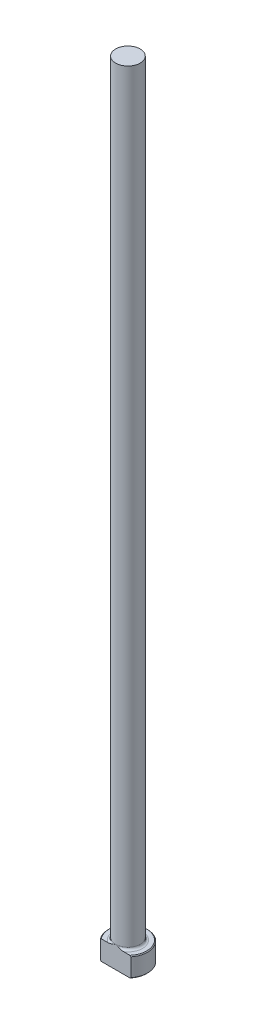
from build123d import *

# Parameters (mm, degrees)
CHAMFER1_SIZE = 0.254
FILLET1_R     = 0.762
KEY_DEPTH     = 255.158700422


with BuildPart() as part:
    # Sketch1 → Revolve1 (revolve)
    with BuildSketch(Plane.XY, mode=Mode.PRIVATE) as revolve1_sk:
        Polygon((0, 0), (-6.35, 0), (-6.35, 6.35), (-3.96875, 6.35), (-3.96875, 254), (0, 254), align=None)
    revolve(revolve1_sk.sketch.rotate(Axis((0, 259.958771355, 0), (0, -1, 0)), 270), axis=Axis((0, 259.958771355, 0), (0, -1, 0)))

    # Chamfer1
    chamfer1_edges = [part.edges().sort_by_distance(p)[0] for p in [
        (0, 6.35, -6.35),
        (0, 0, -6.35),
    ]]
    chamfer(chamfer1_edges, length=CHAMFER1_SIZE)

    # Fillet1
    fillet1_edges = [part.edges().sort_by_distance(p)[0] for p in [
        (0, 6.35, -3.96875),
    ]]
    fillet(fillet1_edges, radius=FILLET1_R)

    # Sketch2 → Key (cut, through all)
    with BuildSketch(Plane(origin=(0, 0, 0), x_dir=(1, 0, 0), z_dir=(0, 1, 0))):
        with BuildLine():
            Line((-4.956967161, -3.96875), (4.956967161, -3.96875))
            ThreePointArc((4.956967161, -3.96875), (0, -6.35), (-4.956967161, -3.96875))
        make_face()
    extrude(amount=KEY_DEPTH, mode=Mode.SUBTRACT)


solid = part.part
